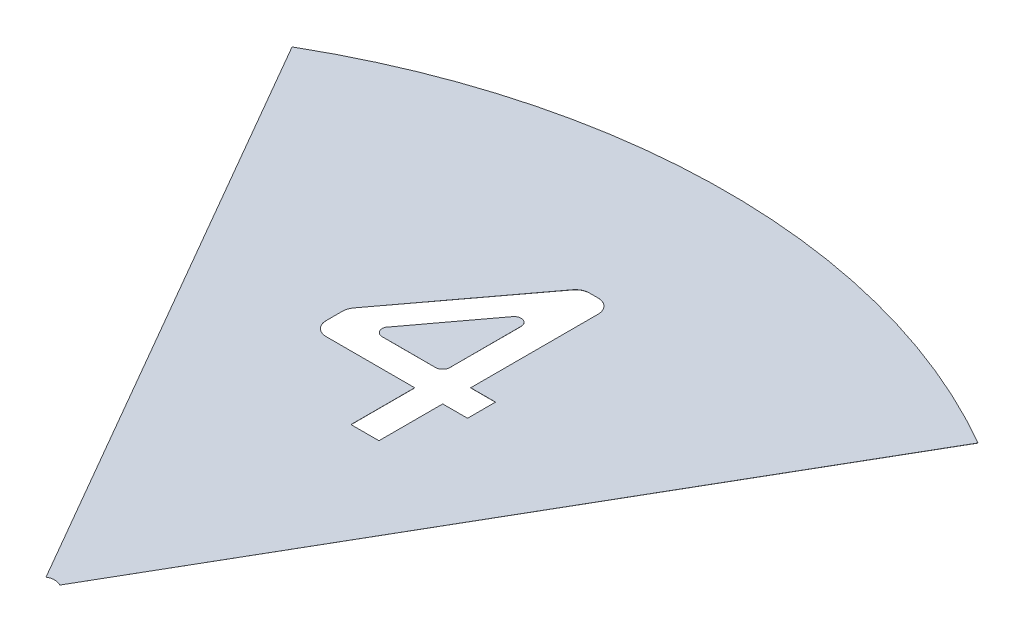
ISO-10303-21;
HEADER;
FILE_DESCRIPTION(('STEP AP214'),'2;1');
FILE_NAME('part.step','',(''),(''),'','','');
FILE_SCHEMA(('AUTOMOTIVE_DESIGN { 1 0 10303 214 1 1 1 1 }'));
ENDSEC;
DATA;
#1=APPLICATION_CONTEXT('core data for automotive mechanical design processes');
#2=APPLICATION_PROTOCOL_DEFINITION('international standard','automotive_design',2000,#1);
#3=PRODUCT_CONTEXT('',#1,'mechanical');
#4=PRODUCT('Part','Part','',(#3));
#5=PRODUCT_RELATED_PRODUCT_CATEGORY('part','',(#4));
#6=PRODUCT_DEFINITION_FORMATION('','',#4);
#7=PRODUCT_DEFINITION_CONTEXT('part definition',#1,'design');
#8=PRODUCT_DEFINITION('design','',#6,#7);
#9=PRODUCT_DEFINITION_SHAPE('','',#8);
#10=(LENGTH_UNIT() NAMED_UNIT(*) SI_UNIT(.MILLI.,.METRE.));
#11=(NAMED_UNIT(*) PLANE_ANGLE_UNIT() SI_UNIT($,.RADIAN.));
#12=(NAMED_UNIT(*) SI_UNIT($,.STERADIAN.) SOLID_ANGLE_UNIT());
#13=UNCERTAINTY_MEASURE_WITH_UNIT(LENGTH_MEASURE(1.E-05),#10,'distance_accuracy_value','');
#14=(GEOMETRIC_REPRESENTATION_CONTEXT(3) GLOBAL_UNCERTAINTY_ASSIGNED_CONTEXT((#13)) GLOBAL_UNIT_ASSIGNED_CONTEXT((#10,
#11,#12)) REPRESENTATION_CONTEXT('',''));
#15=CARTESIAN_POINT('',(0.,0.,0.));
#16=DIRECTION('',(0.,0.,1.));
#17=DIRECTION('',(1.,0.,0.));
#18=AXIS2_PLACEMENT_3D('',#15,#16,#17);
#19=CARTESIAN_POINT('',(-7.76761262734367,-18.3543188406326,-23.9802611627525));
#20=DIRECTION('',(0.,1.,0.));
#21=DIRECTION('',(0.,0.,1.));
#22=AXIS2_PLACEMENT_3D('',#19,#20,#21);
#23=CYLINDRICAL_SURFACE('',#22,0.510000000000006);
#24=CARTESIAN_POINT('',(-7.76761262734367,-8.36431884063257,-23.9802611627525));
#25=DIRECTION('',(0.,1.,0.));
#26=DIRECTION('',(0.,0.,1.));
#27=AXIS2_PLACEMENT_3D('',#24,#25,#26);
#28=CIRCLE('',#27,0.510000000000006);
#29=CARTESIAN_POINT('',(-7.25761262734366,-8.36431884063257,-23.9802611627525));
#30=VERTEX_POINT('',#29);
#31=CARTESIAN_POINT('',(-8.17575951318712,-8.36431884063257,-24.2860652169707));
#32=VERTEX_POINT('',#31);
#33=EDGE_CURVE('P0_E55',#30,#32,#28,.T.);
#34=ORIENTED_EDGE('',*,*,#33,.T.);
#35=DIRECTION('',(0.,1.,0.));
#36=VECTOR('',#35,1.);
#37=CARTESIAN_POINT('',(-8.17575951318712,-18.3543188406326,-24.2860652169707));
#38=LINE('',#37,#36);
#39=CARTESIAN_POINT('',(-8.17575951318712,-8.35431884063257,-24.2860652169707));
#40=VERTEX_POINT('',#39);
#41=EDGE_CURVE('P0_E56',#32,#40,#38,.T.);
#42=ORIENTED_EDGE('',*,*,#41,.T.);
#43=CARTESIAN_POINT('',(-7.76761262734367,-8.35431884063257,-23.9802611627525));
#44=DIRECTION('',(0.,1.,0.));
#45=DIRECTION('',(0.,0.,1.));
#46=AXIS2_PLACEMENT_3D('',#43,#44,#45);
#47=CIRCLE('',#46,0.510000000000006);
#48=CARTESIAN_POINT('',(-7.25761262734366,-8.35431884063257,-23.9802611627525));
#49=VERTEX_POINT('',#48);
#50=EDGE_CURVE('P0_E20',#49,#40,#47,.T.);
#51=ORIENTED_EDGE('',*,*,#50,.F.);
#52=DIRECTION('',(0.,1.,0.));
#53=VECTOR('',#52,1.);
#54=CARTESIAN_POINT('',(-7.25761262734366,-18.3543188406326,-23.9802611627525));
#55=LINE('',#54,#53);
#56=EDGE_CURVE('P0_E57',#30,#49,#55,.T.);
#57=ORIENTED_EDGE('',*,*,#56,.F.);
#58=EDGE_LOOP('',(#34,#42,#51,#57));
#59=FACE_BOUND('',#58,.T.);
#60=ADVANCED_FACE('P0_F15',(#59),#23,.T.);
#61=CARTESIAN_POINT('',(-12.0778714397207,-18.3543188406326,-19.078041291));
#62=DIRECTION('',(-0.80028801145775,0.,-0.599615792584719));
#63=DIRECTION('',(-0.599615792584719,0.,0.80028801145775));
#64=AXIS2_PLACEMENT_3D('',#61,#62,#63);
#65=PLANE('',#64);
#66=DIRECTION('',(-0.599615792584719,0.,0.80028801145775));
#67=VECTOR('',#66,1.);
#68=CARTESIAN_POINT('',(-24.6691185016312,-8.36431884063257,-2.27290674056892));
#69=LINE('',#68,#67);
#70=CARTESIAN_POINT('',(-12.0778714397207,-8.35931884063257,-19.078041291));
#71=VERTEX_POINT('',#70);
#72=EDGE_CURVE('P0_E64',#32,#71,#69,.T.);
#73=ORIENTED_EDGE('',*,*,#72,.T.);
#74=CARTESIAN_POINT('',(-8.17575951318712,-8.35431884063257,-24.2860652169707));
#75=CARTESIAN_POINT('',(-12.0778714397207,-8.35431884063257,-19.078041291));
#76=B_SPLINE_CURVE_WITH_KNOTS('',1,(#74,#75),.UNSPECIFIED.,.F.,.F.,(2,2),(0.,1.),.UNSPECIFIED.);
#77=EDGE_CURVE('P0_E10',#40,#71,#76,.T.);
#78=ORIENTED_EDGE('',*,*,#77,.F.);
#79=ORIENTED_EDGE('',*,*,#41,.F.);
#80=EDGE_LOOP('',(#73,#78,#79));
#81=FACE_BOUND('',#80,.T.);
#82=ADVANCED_FACE('P0_F63',(#81),#65,.T.);
#83=CARTESIAN_POINT('',(-7.25761262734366,-18.3543188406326,-23.9802611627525));
#84=DIRECTION('',(1.,0.,0.));
#85=DIRECTION('',(0.,0.,-1.));
#86=AXIS2_PLACEMENT_3D('',#83,#84,#85);
#87=PLANE('',#86);
#88=DIRECTION('',(0.,0.,-1.));
#89=VECTOR('',#88,1.);
#90=CARTESIAN_POINT('',(-7.25761262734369,-8.36431884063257,10.0331602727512));
#91=LINE('',#90,#89);
#92=CARTESIAN_POINT('',(-7.25761262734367,-8.35931884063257,-18.7722372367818));
#93=VERTEX_POINT('',#92);
#94=EDGE_CURVE('P0_E70',#93,#30,#91,.T.);
#95=ORIENTED_EDGE('',*,*,#94,.T.);
#96=ORIENTED_EDGE('',*,*,#56,.T.);
#97=CARTESIAN_POINT('',(-7.25761262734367,-8.35431884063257,-18.7722372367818));
#98=CARTESIAN_POINT('',(-7.25761262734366,-8.35431884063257,-23.9802611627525));
#99=B_SPLINE_CURVE_WITH_KNOTS('',1,(#97,#98),.UNSPECIFIED.,.F.,.F.,(2,2),(0.,1.),.UNSPECIFIED.);
#100=EDGE_CURVE('P0_E133',#93,#49,#99,.T.);
#101=ORIENTED_EDGE('',*,*,#100,.F.);
#102=EDGE_LOOP('',(#95,#96,#101));
#103=FACE_BOUND('',#102,.T.);
#104=ADVANCED_FACE('P0_F105',(#103),#87,.T.);
#105=CARTESIAN_POINT('',(-8.24460463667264,-8.36431884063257,10.0331602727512));
#106=DIRECTION('',(0.,1.,0.));
#107=DIRECTION('',(0.,0.,1.));
#108=AXIS2_PLACEMENT_3D('',#105,#106,#107);
#109=PLANE('',#108);
#110=CARTESIAN_POINT('',(-12.0778714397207,-8.35431884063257,-19.078041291));
#111=CARTESIAN_POINT('',(-12.2645311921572,-8.35431884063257,-18.8262393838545));
#112=CARTESIAN_POINT('',(-12.1258276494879,-8.35431884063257,-18.5440487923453));
#113=CARTESIAN_POINT('',(-12.0578373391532,-8.35431884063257,-18.4057233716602));
#114=CARTESIAN_POINT('',(-11.9176450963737,-8.35431884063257,-18.3265519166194));
#115=CARTESIAN_POINT('',(-11.8049851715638,-8.35431884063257,-18.2629289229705));
#116=CARTESIAN_POINT('',(-11.6697245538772,-8.35431884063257,-18.2622372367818));
#117=B_SPLINE_CURVE_WITH_KNOTS('',2,(#110,#111,#112,#113,#114,#115,#116),.UNSPECIFIED.,.F.,.F.,
(3,2,2,3),(0.,0.5,0.75,1.),.UNSPECIFIED.);
#118=CARTESIAN_POINT('',(-11.6697245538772,-8.35931884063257,-18.2622372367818));
#119=VERTEX_POINT('',#118);
#120=EDGE_CURVE('P0_E68',#71,#119,#117,.T.);
#121=ORIENTED_EDGE('',*,*,#120,.F.);
#122=ORIENTED_EDGE('',*,*,#72,.F.);
#123=ORIENTED_EDGE('',*,*,#33,.F.);
#124=ORIENTED_EDGE('',*,*,#94,.F.);
#125=CARTESIAN_POINT('',(-7.76761262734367,-8.35431884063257,-18.2622372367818));
#126=CARTESIAN_POINT('',(-7.55692243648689,-8.35431884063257,-18.2630878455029));
#127=CARTESIAN_POINT('',(-7.40698816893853,-8.35431884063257,-18.4116127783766));
#128=CARTESIAN_POINT('',(-7.25847460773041,-8.35431884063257,-18.5587303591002));
#129=CARTESIAN_POINT('',(-7.25761262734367,-8.35431884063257,-18.7722372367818));
#130=B_SPLINE_CURVE_WITH_KNOTS('',2,(#125,#126,#127,#128,#129),.UNSPECIFIED.,.F.,.F.,(3,2,3),
(0.,0.5,1.),.UNSPECIFIED.);
#131=CARTESIAN_POINT('',(-7.76761262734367,-8.35931884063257,-18.2622372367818));
#132=VERTEX_POINT('',#131);
#133=EDGE_CURVE('P0_E124',#132,#93,#130,.T.);
#134=ORIENTED_EDGE('',*,*,#133,.F.);
#135=DIRECTION('',(1.,0.,0.));
#136=VECTOR('',#135,1.);
#137=CARTESIAN_POINT('',(-8.24460463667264,-8.36431884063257,-18.2622372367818));
#138=LINE('',#137,#136);
#139=EDGE_CURVE('P0_E72',#119,#132,#138,.T.);
#140=ORIENTED_EDGE('',*,*,#139,.F.);
#141=EDGE_LOOP('',(#121,#122,#123,#124,#134,#140));
#142=FACE_BOUND('',#141,.T.);
#143=ADVANCED_FACE('P0_F66',(#142),#109,.F.);
#144=CARTESIAN_POINT('',(-7.76761262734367,-18.3543188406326,-18.2622372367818));
#145=DIRECTION('',(0.,0.,1.));
#146=DIRECTION('',(1.,0.,0.));
#147=AXIS2_PLACEMENT_3D('',#144,#145,#146);
#148=PLANE('',#147);
#149=ORIENTED_EDGE('',*,*,#139,.T.);
#150=CARTESIAN_POINT('',(-11.6697245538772,-8.35431884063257,-18.2622372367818));
#151=CARTESIAN_POINT('',(-7.76761262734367,-8.35431884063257,-18.2622372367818));
#152=B_SPLINE_CURVE_WITH_KNOTS('',1,(#150,#151),.UNSPECIFIED.,.F.,.F.,(2,2),(0.,1.),.UNSPECIFIED.);
#153=EDGE_CURVE('P0_E115',#119,#132,#152,.T.);
#154=ORIENTED_EDGE('',*,*,#153,.F.);
#155=EDGE_LOOP('',(#149,#154));
#156=FACE_BOUND('',#155,.T.);
#157=ADVANCED_FACE('P0_F104',(#156),#148,.T.);
#158=CARTESIAN_POINT('',(-8.24460463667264,-8.35431884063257,10.0331602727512));
#159=DIRECTION('',(0.,1.,0.));
#160=DIRECTION('',(0.,0.,1.));
#161=AXIS2_PLACEMENT_3D('',#158,#159,#160);
#162=PLANE('',#161);
#163=ORIENTED_EDGE('',*,*,#120,.T.);
#164=ORIENTED_EDGE('',*,*,#153,.T.);
#165=ORIENTED_EDGE('',*,*,#133,.T.);
#166=ORIENTED_EDGE('',*,*,#100,.T.);
#167=ORIENTED_EDGE('',*,*,#50,.T.);
#168=ORIENTED_EDGE('',*,*,#77,.T.);
#169=EDGE_LOOP('',(#163,#164,#165,#166,#167,#168));
#170=FACE_BOUND('',#169,.T.);
#171=ADVANCED_FACE('P0_F17',(#170),#162,.T.);
#172=CLOSED_SHELL('',(#60,#82,#104,#143,#157,#171));
#173=MANIFOLD_SOLID_BREP('P0_B1',#172);
#174=CARTESIAN_POINT('',(-7.25761262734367,-18.3543188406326,-16.2222372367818));
#175=DIRECTION('',(0.,0.,1.));
#176=DIRECTION('',(1.,0.,0.));
#177=AXIS2_PLACEMENT_3D('',#174,#175,#176);
#178=PLANE('',#177);
#179=DIRECTION('',(0.,1.,0.));
#180=VECTOR('',#179,1.);
#181=CARTESIAN_POINT('',(-13.7091126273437,-18.3543188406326,-16.2222372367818));
#182=LINE('',#181,#180);
#183=CARTESIAN_POINT('',(-13.7091126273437,-8.36431884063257,-16.2222372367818));
#184=VERTEX_POINT('',#183);
#185=CARTESIAN_POINT('',(-13.7091126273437,-8.35431884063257,-16.2222372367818));
#186=VERTEX_POINT('',#185);
#187=EDGE_CURVE('P1_E281',#184,#186,#182,.T.);
#188=ORIENTED_EDGE('',*,*,#187,.T.);
#189=DIRECTION('',(1.,0.,0.));
#190=VECTOR('',#189,1.);
#191=CARTESIAN_POINT('',(-7.25761262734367,-8.35431884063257,-16.2222372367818));
#192=LINE('',#191,#190);
#193=CARTESIAN_POINT('',(-7.25761262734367,-8.35431884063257,-16.2222372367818));
#194=VERTEX_POINT('',#193);
#195=EDGE_CURVE('P1_E289',#186,#194,#192,.T.);
#196=ORIENTED_EDGE('',*,*,#195,.T.);
#197=DIRECTION('',(0.,1.,0.));
#198=VECTOR('',#197,1.);
#199=CARTESIAN_POINT('',(-7.25761262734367,-18.3543188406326,-16.2222372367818));
#200=LINE('',#199,#198);
#201=CARTESIAN_POINT('',(-7.25761279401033,-8.36431884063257,-16.2222372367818));
#202=VERTEX_POINT('',#201);
#203=EDGE_CURVE('P1_E295',#202,#194,#200,.T.);
#204=ORIENTED_EDGE('',*,*,#203,.F.);
#205=CARTESIAN_POINT('',(-13.7091126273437,-8.36431884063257,-16.2222372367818));
#206=CARTESIAN_POINT('',(-7.25761262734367,-8.36431884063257,-16.2222372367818));
#207=B_SPLINE_CURVE_WITH_KNOTS('',1,(#205,#206),.UNSPECIFIED.,.F.,.F.,(2,2),(0.,1.),.UNSPECIFIED.);
#208=EDGE_CURVE('P1_E187',#184,#202,#207,.T.);
#209=ORIENTED_EDGE('',*,*,#208,.F.);
#210=EDGE_LOOP('',(#188,#196,#204,#209));
#211=FACE_BOUND('',#210,.T.);
#212=ADVANCED_FACE('P1_F15',(#211),#178,.F.);
#213=CARTESIAN_POINT('',(-7.25761262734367,-18.3543188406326,-11.5755705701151));
#214=DIRECTION('',(-1.,0.,0.));
#215=DIRECTION('',(0.,0.,1.));
#216=AXIS2_PLACEMENT_3D('',#213,#214,#215);
#217=PLANE('',#216);
#218=ORIENTED_EDGE('',*,*,#203,.T.);
#219=DIRECTION('',(0.,0.,1.));
#220=VECTOR('',#219,1.);
#221=CARTESIAN_POINT('',(-7.25761262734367,-8.35431884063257,-11.5755705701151));
#222=LINE('',#221,#220);
#223=CARTESIAN_POINT('',(-7.25761262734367,-8.35431884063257,-11.5755705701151));
#224=VERTEX_POINT('',#223);
#225=EDGE_CURVE('P1_E303',#194,#224,#222,.T.);
#226=ORIENTED_EDGE('',*,*,#225,.T.);
#227=DIRECTION('',(0.,1.,0.));
#228=VECTOR('',#227,1.);
#229=CARTESIAN_POINT('',(-7.25761262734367,-18.3543188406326,-11.5755705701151));
#230=LINE('',#229,#228);
#231=CARTESIAN_POINT('',(-7.25761262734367,-8.36431884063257,-11.5755707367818));
#232=VERTEX_POINT('',#231);
#233=EDGE_CURVE('P1_E306',#232,#224,#230,.T.);
#234=ORIENTED_EDGE('',*,*,#233,.F.);
#235=CARTESIAN_POINT('',(-7.25761262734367,-8.36431884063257,-16.2222372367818));
#236=CARTESIAN_POINT('',(-7.25761262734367,-8.36431884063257,-11.5755705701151));
#237=B_SPLINE_CURVE_WITH_KNOTS('',1,(#235,#236),.UNSPECIFIED.,.F.,.F.,(2,2),(0.,1.),.UNSPECIFIED.);
#238=EDGE_CURVE('P1_E188',#202,#232,#237,.T.);
#239=ORIENTED_EDGE('',*,*,#238,.F.);
#240=EDGE_LOOP('',(#218,#226,#234,#239));
#241=FACE_BOUND('',#240,.T.);
#242=ADVANCED_FACE('P1_F453',(#241),#217,.F.);
#243=CARTESIAN_POINT('',(-5.21761262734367,-18.3543188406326,-11.5755705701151));
#244=DIRECTION('',(0.,0.,1.));
#245=DIRECTION('',(1.,0.,0.));
#246=AXIS2_PLACEMENT_3D('',#243,#244,#245);
#247=PLANE('',#246);
#248=ORIENTED_EDGE('',*,*,#233,.T.);
#249=DIRECTION('',(1.,0.,0.));
#250=VECTOR('',#249,1.);
#251=CARTESIAN_POINT('',(-5.21761262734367,-8.35431884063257,-11.5755705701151));
#252=LINE('',#251,#250);
#253=CARTESIAN_POINT('',(-5.21761262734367,-8.35431884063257,-11.5755705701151));
#254=VERTEX_POINT('',#253);
#255=EDGE_CURVE('P1_E309',#224,#254,#252,.T.);
#256=ORIENTED_EDGE('',*,*,#255,.T.);
#257=DIRECTION('',(0.,1.,0.));
#258=VECTOR('',#257,1.);
#259=CARTESIAN_POINT('',(-5.21761262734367,-18.3543188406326,-11.5755705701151));
#260=LINE('',#259,#258);
#261=CARTESIAN_POINT('',(-5.21761279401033,-8.36431884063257,-11.5755705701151));
#262=VERTEX_POINT('',#261);
#263=EDGE_CURVE('P1_E312',#262,#254,#260,.T.);
#264=ORIENTED_EDGE('',*,*,#263,.F.);
#265=CARTESIAN_POINT('',(-7.25761262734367,-8.36431884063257,-11.5755705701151));
#266=CARTESIAN_POINT('',(-5.21761262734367,-8.36431884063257,-11.5755705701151));
#267=B_SPLINE_CURVE_WITH_KNOTS('',1,(#265,#266),.UNSPECIFIED.,.F.,.F.,(2,2),(0.,1.),.UNSPECIFIED.);
#268=EDGE_CURVE('P1_E192',#232,#262,#267,.T.);
#269=ORIENTED_EDGE('',*,*,#268,.F.);
#270=EDGE_LOOP('',(#248,#256,#264,#269));
#271=FACE_BOUND('',#270,.T.);
#272=ADVANCED_FACE('P1_F418',(#271),#247,.F.);
#273=CARTESIAN_POINT('',(-5.21761262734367,-18.3543188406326,-16.2222372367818));
#274=DIRECTION('',(1.,0.,0.));
#275=DIRECTION('',(0.,0.,-1.));
#276=AXIS2_PLACEMENT_3D('',#273,#274,#275);
#277=PLANE('',#276);
#278=ORIENTED_EDGE('',*,*,#263,.T.);
#279=DIRECTION('',(0.,0.,-1.));
#280=VECTOR('',#279,1.);
#281=CARTESIAN_POINT('',(-5.21761262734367,-8.35431884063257,-16.2222372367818));
#282=LINE('',#281,#280);
#283=CARTESIAN_POINT('',(-5.21761262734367,-8.35431884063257,-16.2222372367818));
#284=VERTEX_POINT('',#283);
#285=EDGE_CURVE('P1_E315',#254,#284,#282,.T.);
#286=ORIENTED_EDGE('',*,*,#285,.T.);
#287=DIRECTION('',(0.,1.,0.));
#288=VECTOR('',#287,1.);
#289=CARTESIAN_POINT('',(-5.21761262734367,-18.3543188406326,-16.2222372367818));
#290=LINE('',#289,#288);
#291=CARTESIAN_POINT('',(-5.21761262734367,-8.36431884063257,-16.2222370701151));
#292=VERTEX_POINT('',#291);
#293=EDGE_CURVE('P1_E318',#292,#284,#290,.T.);
#294=ORIENTED_EDGE('',*,*,#293,.F.);
#295=CARTESIAN_POINT('',(-5.21761262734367,-8.36431884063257,-11.5755705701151));
#296=CARTESIAN_POINT('',(-5.21761262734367,-8.36431884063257,-16.2222372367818));
#297=B_SPLINE_CURVE_WITH_KNOTS('',1,(#295,#296),.UNSPECIFIED.,.F.,.F.,(2,2),(0.,1.),.UNSPECIFIED.);
#298=EDGE_CURVE('P1_E389',#262,#292,#297,.T.);
#299=ORIENTED_EDGE('',*,*,#298,.F.);
#300=EDGE_LOOP('',(#278,#286,#294,#299));
#301=FACE_BOUND('',#300,.T.);
#302=ADVANCED_FACE('P1_F427',(#301),#277,.F.);
#303=CARTESIAN_POINT('',(-3.40711262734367,-18.3543188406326,-16.2222372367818));
#304=DIRECTION('',(0.,0.,1.));
#305=DIRECTION('',(1.,0.,0.));
#306=AXIS2_PLACEMENT_3D('',#303,#304,#305);
#307=PLANE('',#306);
#308=ORIENTED_EDGE('',*,*,#293,.T.);
#309=DIRECTION('',(1.,0.,0.));
#310=VECTOR('',#309,1.);
#311=CARTESIAN_POINT('',(-3.40711262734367,-8.35431884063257,-16.2222372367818));
#312=LINE('',#311,#310);
#313=CARTESIAN_POINT('',(-3.40711262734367,-8.35431884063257,-16.2222372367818));
#314=VERTEX_POINT('',#313);
#315=EDGE_CURVE('P1_E321',#284,#314,#312,.T.);
#316=ORIENTED_EDGE('',*,*,#315,.T.);
#317=DIRECTION('',(0.,1.,0.));
#318=VECTOR('',#317,1.);
#319=CARTESIAN_POINT('',(-3.40711262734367,-18.3543188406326,-16.2222372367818));
#320=LINE('',#319,#318);
#321=CARTESIAN_POINT('',(-3.40711279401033,-8.36431884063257,-16.2222372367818));
#322=VERTEX_POINT('',#321);
#323=EDGE_CURVE('P1_E324',#322,#314,#320,.T.);
#324=ORIENTED_EDGE('',*,*,#323,.F.);
#325=CARTESIAN_POINT('',(-5.21761262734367,-8.36431884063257,-16.2222372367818));
#326=CARTESIAN_POINT('',(-3.40711262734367,-8.36431884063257,-16.2222372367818));
#327=B_SPLINE_CURVE_WITH_KNOTS('',1,(#325,#326),.UNSPECIFIED.,.F.,.F.,(2,2),(0.,1.),.UNSPECIFIED.);
#328=EDGE_CURVE('P1_E379',#292,#322,#327,.T.);
#329=ORIENTED_EDGE('',*,*,#328,.F.);
#330=EDGE_LOOP('',(#308,#316,#324,#329));
#331=FACE_BOUND('',#330,.T.);
#332=ADVANCED_FACE('P1_F433',(#331),#307,.F.);
#333=CARTESIAN_POINT('',(-3.40711262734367,-18.3543188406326,-18.2622372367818));
#334=DIRECTION('',(1.,0.,0.));
#335=DIRECTION('',(0.,0.,-1.));
#336=AXIS2_PLACEMENT_3D('',#333,#334,#335);
#337=PLANE('',#336);
#338=ORIENTED_EDGE('',*,*,#323,.T.);
#339=DIRECTION('',(0.,0.,-1.));
#340=VECTOR('',#339,1.);
#341=CARTESIAN_POINT('',(-3.40711262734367,-8.35431884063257,-18.2622372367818));
#342=LINE('',#341,#340);
#343=CARTESIAN_POINT('',(-3.40711262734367,-8.35431884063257,-18.2622372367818));
#344=VERTEX_POINT('',#343);
#345=EDGE_CURVE('P1_E327',#314,#344,#342,.T.);
#346=ORIENTED_EDGE('',*,*,#345,.T.);
#347=DIRECTION('',(0.,1.,0.));
#348=VECTOR('',#347,1.);
#349=CARTESIAN_POINT('',(-3.40711262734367,-18.3543188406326,-18.2622372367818));
#350=LINE('',#349,#348);
#351=CARTESIAN_POINT('',(-3.40711262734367,-8.36431884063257,-18.2622370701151));
#352=VERTEX_POINT('',#351);
#353=EDGE_CURVE('P1_E330',#352,#344,#350,.T.);
#354=ORIENTED_EDGE('',*,*,#353,.F.);
#355=CARTESIAN_POINT('',(-3.40711262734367,-8.36431884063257,-16.2222372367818));
#356=CARTESIAN_POINT('',(-3.40711262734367,-8.36431884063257,-18.2622372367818));
#357=B_SPLINE_CURVE_WITH_KNOTS('',1,(#355,#356),.UNSPECIFIED.,.F.,.F.,(2,2),(0.,1.),.UNSPECIFIED.);
#358=EDGE_CURVE('P1_E369',#322,#352,#357,.T.);
#359=ORIENTED_EDGE('',*,*,#358,.F.);
#360=EDGE_LOOP('',(#338,#346,#354,#359));
#361=FACE_BOUND('',#360,.T.);
#362=ADVANCED_FACE('P1_F437',(#361),#337,.F.);
#363=CARTESIAN_POINT('',(-5.21761262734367,-18.3543188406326,-18.2622372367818));
#364=DIRECTION('',(0.,0.,-1.));
#365=DIRECTION('',(-1.,0.,0.));
#366=AXIS2_PLACEMENT_3D('',#363,#364,#365);
#367=PLANE('',#366);
#368=ORIENTED_EDGE('',*,*,#353,.T.);
#369=DIRECTION('',(-1.,0.,0.));
#370=VECTOR('',#369,1.);
#371=CARTESIAN_POINT('',(-5.21761262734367,-8.35431884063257,-18.2622372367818));
#372=LINE('',#371,#370);
#373=CARTESIAN_POINT('',(-5.21761262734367,-8.35431884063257,-18.2622372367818));
#374=VERTEX_POINT('',#373);
#375=EDGE_CURVE('P1_E333',#344,#374,#372,.T.);
#376=ORIENTED_EDGE('',*,*,#375,.T.);
#377=DIRECTION('',(0.,1.,0.));
#378=VECTOR('',#377,1.);
#379=CARTESIAN_POINT('',(-5.21761262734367,-18.3543188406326,-18.2622372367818));
#380=LINE('',#379,#378);
#381=CARTESIAN_POINT('',(-5.217612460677,-8.36431884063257,-18.2622372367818));
#382=VERTEX_POINT('',#381);
#383=EDGE_CURVE('P1_E336',#382,#374,#380,.T.);
#384=ORIENTED_EDGE('',*,*,#383,.F.);
#385=CARTESIAN_POINT('',(-3.40711262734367,-8.36431884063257,-18.2622372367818));
#386=CARTESIAN_POINT('',(-5.21761262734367,-8.36431884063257,-18.2622372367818));
#387=B_SPLINE_CURVE_WITH_KNOTS('',1,(#385,#386),.UNSPECIFIED.,.F.,.F.,(2,2),(0.,1.),.UNSPECIFIED.);
#388=EDGE_CURVE('P1_E360',#352,#382,#387,.T.);
#389=ORIENTED_EDGE('',*,*,#388,.F.);
#390=EDGE_LOOP('',(#368,#376,#384,#389));
#391=FACE_BOUND('',#390,.T.);
#392=ADVANCED_FACE('P1_F445',(#391),#367,.F.);
#393=CARTESIAN_POINT('',(-5.21761262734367,-18.3543188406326,-27.5555705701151));
#394=DIRECTION('',(1.,0.,0.));
#395=DIRECTION('',(0.,0.,-1.));
#396=AXIS2_PLACEMENT_3D('',#393,#394,#395);
#397=PLANE('',#396);
#398=ORIENTED_EDGE('',*,*,#383,.T.);
#399=DIRECTION('',(0.,0.,-1.));
#400=VECTOR('',#399,1.);
#401=CARTESIAN_POINT('',(-5.21761262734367,-8.35431884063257,-27.5555705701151));
#402=LINE('',#401,#400);
#403=CARTESIAN_POINT('',(-5.21761262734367,-8.35431884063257,-27.5555705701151));
#404=VERTEX_POINT('',#403);
#405=EDGE_CURVE('P1_E339',#374,#404,#402,.T.);
#406=ORIENTED_EDGE('',*,*,#405,.T.);
#407=DIRECTION('',(0.,1.,0.));
#408=VECTOR('',#407,1.);
#409=CARTESIAN_POINT('',(-5.21761262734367,-18.3543188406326,-27.5555705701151));
#410=LINE('',#409,#408);
#411=CARTESIAN_POINT('',(-5.21761262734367,-8.36431884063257,-27.5555705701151));
#412=VERTEX_POINT('',#411);
#413=EDGE_CURVE('P1_E107',#412,#404,#410,.T.);
#414=ORIENTED_EDGE('',*,*,#413,.F.);
#415=CARTESIAN_POINT('',(-5.21761262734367,-8.36431884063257,-18.2622372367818));
#416=CARTESIAN_POINT('',(-5.21761262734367,-8.36431884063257,-27.5555705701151));
#417=B_SPLINE_CURVE_WITH_KNOTS('',1,(#415,#416),.UNSPECIFIED.,.F.,.F.,(2,2),(0.,1.),.UNSPECIFIED.);
#418=EDGE_CURVE('P1_E118',#382,#412,#417,.T.);
#419=ORIENTED_EDGE('',*,*,#418,.F.);
#420=EDGE_LOOP('',(#398,#406,#414,#419));
#421=FACE_BOUND('',#420,.T.);
#422=ADVANCED_FACE('P1_F261',(#421),#397,.F.);
#423=CARTESIAN_POINT('',(-8.24460463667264,-8.35431884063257,10.0331602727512));
#424=DIRECTION('',(0.,-1.,0.));
#425=DIRECTION('',(0.,0.,-1.));
#426=AXIS2_PLACEMENT_3D('',#423,#424,#425);
#427=CYLINDRICAL_SURFACE('',#426,50.);
#428=CARTESIAN_POINT('',(-8.24460463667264,-8.36431884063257,10.0331602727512));
#429=DIRECTION('',(0.,1.,0.));
#430=DIRECTION('',(0.499999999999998,0.,-0.86602540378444));
#431=AXIS2_PLACEMENT_3D('',#428,#429,#430);
#432=CIRCLE('',#431,50.);
#433=CARTESIAN_POINT('',(16.7553953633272,-8.36431884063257,-33.2681099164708));
#434=VERTEX_POINT('',#433);
#435=CARTESIAN_POINT('',(-33.2446046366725,-8.36431884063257,-33.2681099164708));
#436=VERTEX_POINT('',#435);
#437=EDGE_CURVE('P1_E218',#434,#436,#432,.T.);
#438=ORIENTED_EDGE('',*,*,#437,.T.);
#439=DIRECTION('',(0.,-1.,0.));
#440=VECTOR('',#439,1.);
#441=CARTESIAN_POINT('',(-33.2446046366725,-8.35431884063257,-33.2681099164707));
#442=LINE('',#441,#440);
#443=CARTESIAN_POINT('',(-33.2446046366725,-8.35431884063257,-33.2681099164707));
#444=VERTEX_POINT('',#443);
#445=EDGE_CURVE('P1_E238',#444,#436,#442,.T.);
#446=ORIENTED_EDGE('',*,*,#445,.F.);
#447=CARTESIAN_POINT('',(-8.24460463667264,-8.35431884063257,10.0331602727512));
#448=DIRECTION('',(0.,1.,0.));
#449=DIRECTION('',(0.,0.,1.));
#450=AXIS2_PLACEMENT_3D('',#447,#448,#449);
#451=CIRCLE('',#450,50.);
#452=CARTESIAN_POINT('',(16.7553953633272,-8.35431884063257,-33.2681099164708));
#453=VERTEX_POINT('',#452);
#454=EDGE_CURVE('P1_E235',#453,#444,#451,.T.);
#455=ORIENTED_EDGE('',*,*,#454,.F.);
#456=DIRECTION('',(0.,-1.,0.));
#457=VECTOR('',#456,1.);
#458=CARTESIAN_POINT('',(16.7553953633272,-8.35431884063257,-33.2681099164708));
#459=LINE('',#458,#457);
#460=EDGE_CURVE('P1_E36',#453,#434,#459,.T.);
#461=ORIENTED_EDGE('',*,*,#460,.T.);
#462=EDGE_LOOP('',(#438,#446,#455,#461));
#463=FACE_BOUND('',#462,.T.);
#464=ADVANCED_FACE('P1_F250',(#463),#427,.T.);
#465=CARTESIAN_POINT('',(-8.74460463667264,-8.35431884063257,9.16713486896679));
#466=DIRECTION('',(0.86602540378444,0.,-0.499999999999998));
#467=DIRECTION('',(-0.499999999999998,0.,-0.86602540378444));
#468=AXIS2_PLACEMENT_3D('',#465,#466,#467);
#469=PLANE('',#468);
#470=CARTESIAN_POINT('',(-33.2446046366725,-8.36431884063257,-33.2681099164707));
#471=CARTESIAN_POINT('',(-8.74460463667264,-8.36431884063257,9.16713486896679));
#472=B_SPLINE_CURVE_WITH_KNOTS('',1,(#470,#471),.UNSPECIFIED.,.F.,.F.,(2,2),(0.,1.),.UNSPECIFIED.);
#473=CARTESIAN_POINT('',(-8.74460463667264,-8.35931884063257,9.16713486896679));
#474=VERTEX_POINT('',#473);
#475=EDGE_CURVE('P1_E212',#436,#474,#472,.T.);
#476=ORIENTED_EDGE('',*,*,#475,.T.);
#477=DIRECTION('',(0.499999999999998,0.,0.86602540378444));
#478=VECTOR('',#477,1.);
#479=CARTESIAN_POINT('',(-8.74460463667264,-8.35431884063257,9.16713486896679));
#480=LINE('',#479,#478);
#481=EDGE_CURVE('P1_E234',#444,#474,#480,.T.);
#482=ORIENTED_EDGE('',*,*,#481,.F.);
#483=ORIENTED_EDGE('',*,*,#445,.T.);
#484=EDGE_LOOP('',(#476,#482,#483));
#485=FACE_BOUND('',#484,.T.);
#486=ADVANCED_FACE('P1_F260',(#485),#469,.F.);
#487=CARTESIAN_POINT('',(-7.74460463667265,-8.35431884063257,9.16713486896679));
#488=DIRECTION('',(-0.86602540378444,0.,-0.499999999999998));
#489=DIRECTION('',(-0.499999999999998,0.,0.86602540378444));
#490=AXIS2_PLACEMENT_3D('',#487,#488,#489);
#491=PLANE('',#490);
#492=CARTESIAN_POINT('',(-7.74460463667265,-8.36431884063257,9.16713486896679));
#493=CARTESIAN_POINT('',(16.7553953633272,-8.36431884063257,-33.2681099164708));
#494=B_SPLINE_CURVE_WITH_KNOTS('',1,(#492,#493),.UNSPECIFIED.,.F.,.F.,(2,2),(0.,1.),.UNSPECIFIED.);
#495=CARTESIAN_POINT('',(-7.74460463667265,-8.35931884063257,9.16713486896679));
#496=VERTEX_POINT('',#495);
#497=EDGE_CURVE('P1_E10',#496,#434,#494,.T.);
#498=ORIENTED_EDGE('',*,*,#497,.T.);
#499=ORIENTED_EDGE('',*,*,#460,.F.);
#500=DIRECTION('',(0.499999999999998,0.,-0.86602540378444));
#501=VECTOR('',#500,1.);
#502=CARTESIAN_POINT('',(-7.74460463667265,-8.35431884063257,9.16713486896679));
#503=LINE('',#502,#501);
#504=EDGE_CURVE('P1_E173',#496,#453,#503,.T.);
#505=ORIENTED_EDGE('',*,*,#504,.F.);
#506=EDGE_LOOP('',(#498,#499,#505));
#507=FACE_BOUND('',#506,.T.);
#508=ADVANCED_FACE('P1_F265',(#507),#491,.F.);
#509=CARTESIAN_POINT('',(-13.7091126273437,-18.3543188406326,-17.2422372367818));
#510=DIRECTION('',(0.,1.,0.));
#511=DIRECTION('',(0.,0.,1.));
#512=AXIS2_PLACEMENT_3D('',#509,#510,#511);
#513=CYLINDRICAL_SURFACE('',#512,1.02);
#514=CARTESIAN_POINT('',(-13.7091126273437,-8.35431884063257,-17.2422372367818));
#515=DIRECTION('',(0.,1.,0.));
#516=DIRECTION('',(0.,0.,1.));
#517=AXIS2_PLACEMENT_3D('',#514,#515,#516);
#518=CIRCLE('',#517,1.02);
#519=CARTESIAN_POINT('',(-14.7291126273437,-8.35931884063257,-17.2422372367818));
#520=VERTEX_POINT('',#519);
#521=EDGE_CURVE('P1_E164',#520,#186,#518,.T.);
#522=ORIENTED_EDGE('',*,*,#521,.T.);
#523=ORIENTED_EDGE('',*,*,#187,.F.);
#524=CARTESIAN_POINT('',(-14.7291126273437,-8.36431884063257,-17.2422372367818));
#525=CARTESIAN_POINT('',(-14.7290643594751,-8.36431884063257,-17.1481353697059));
#526=CARTESIAN_POINT('',(-14.7120841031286,-8.36431884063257,-17.0566349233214));
#527=CARTESIAN_POINT('',(-14.6938802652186,-8.36431884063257,-16.9585410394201));
#528=CARTESIAN_POINT('',(-14.6574966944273,-8.36431884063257,-16.8667806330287));
#529=CARTESIAN_POINT('',(-14.6191875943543,-8.36431884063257,-16.7701639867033));
#530=CARTESIAN_POINT('',(-14.5628480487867,-8.36431884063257,-16.6840832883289));
#531=CARTESIAN_POINT('',(-14.5047223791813,-8.36431884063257,-16.5952735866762));
#532=CARTESIAN_POINT('',(-14.4303615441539,-8.36431884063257,-16.5209883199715));
#533=CARTESIAN_POINT('',(-14.3552709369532,-8.36431884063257,-16.4459740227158));
#534=CARTESIAN_POINT('',(-14.2672665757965,-8.36431884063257,-16.3885018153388));
#535=CARTESIAN_POINT('',(-14.1802452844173,-8.36431884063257,-16.3316716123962));
#536=CARTESIAN_POINT('',(-14.0845692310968,-8.36431884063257,-16.2938531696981));
#537=CARTESIAN_POINT('',(-13.9917861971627,-8.36431884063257,-16.2571782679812));
#538=CARTESIAN_POINT('',(-13.8947149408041,-8.36431884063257,-16.2392657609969));
#539=CARTESIAN_POINT('',(-13.8026942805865,-8.36431884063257,-16.2222852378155));
#540=CARTESIAN_POINT('',(-13.7091126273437,-8.36431884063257,-16.2222372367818));
#541=B_SPLINE_CURVE_WITH_KNOTS('',2,(#524,#525,#526,#527,#528,#529,#530,#531,#532,#533,#534,
#535,#536,#537,#538,#539,#540),.UNSPECIFIED.,.F.,.F.,(3,2,2,2,2,2,2,2,3),(0.,0.125,0.25,0.375,
0.5,0.625,0.75,0.875,1.),.UNSPECIFIED.);
#542=EDGE_CURVE('P1_E181',#520,#184,#541,.T.);
#543=ORIENTED_EDGE('',*,*,#542,.F.);
#544=EDGE_LOOP('',(#522,#523,#543));
#545=FACE_BOUND('',#544,.T.);
#546=ADVANCED_FACE('P1_F269',(#545),#513,.F.);
#547=CARTESIAN_POINT('',(-7.68880639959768,-18.3543188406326,-28.1671786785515));
#548=DIRECTION('',(-0.800288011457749,0.,-0.59961579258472));
#549=DIRECTION('',(-0.59961579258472,0.,0.800288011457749));
#550=AXIS2_PLACEMENT_3D('',#547,#548,#549);
#551=PLANE('',#550);
#552=DIRECTION('',(0.,1.,0.));
#553=VECTOR('',#552,1.);
#554=CARTESIAN_POINT('',(-7.68880639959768,-18.3543188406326,-28.1671786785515));
#555=LINE('',#554,#553);
#556=CARTESIAN_POINT('',(-7.68880639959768,-8.36431884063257,-28.1671786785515));
#557=VERTEX_POINT('',#556);
#558=CARTESIAN_POINT('',(-7.68880639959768,-8.35431884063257,-28.1671786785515));
#559=VERTEX_POINT('',#558);
#560=EDGE_CURVE('P1_E172',#557,#559,#555,.T.);
#561=ORIENTED_EDGE('',*,*,#560,.T.);
#562=DIRECTION('',(-0.59961579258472,0.,0.800288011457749));
#563=VECTOR('',#562,1.);
#564=CARTESIAN_POINT('',(-7.68880639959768,-8.35431884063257,-28.1671786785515));
#565=LINE('',#564,#563);
#566=CARTESIAN_POINT('',(-14.5254063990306,-8.35931884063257,-19.0425874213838));
#567=VERTEX_POINT('',#566);
#568=EDGE_CURVE('P1_E545',#559,#567,#565,.T.);
#569=ORIENTED_EDGE('',*,*,#568,.T.);
#570=CARTESIAN_POINT('',(-7.68880639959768,-8.36431884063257,-28.1671786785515));
#571=CARTESIAN_POINT('',(-14.5254063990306,-8.36431884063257,-19.0425874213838));
#572=B_SPLINE_CURVE_WITH_KNOTS('',1,(#570,#571),.UNSPECIFIED.,.F.,.F.,(2,2),(0.,1.),.UNSPECIFIED.);
#573=EDGE_CURVE('P1_E186',#557,#567,#572,.T.);
#574=ORIENTED_EDGE('',*,*,#573,.F.);
#575=EDGE_LOOP('',(#561,#569,#574));
#576=FACE_BOUND('',#575,.T.);
#577=ADVANCED_FACE('P1_F273',(#576),#551,.F.);
#578=CARTESIAN_POINT('',(-6.87251262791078,-18.3543188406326,-27.5555705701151));
#579=DIRECTION('',(0.,1.,0.));
#580=DIRECTION('',(0.,0.,1.));
#581=AXIS2_PLACEMENT_3D('',#578,#579,#580);
#582=CYLINDRICAL_SURFACE('',#581,1.01999999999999);
#583=CARTESIAN_POINT('',(-6.87251262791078,-8.35431884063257,-27.5555705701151));
#584=DIRECTION('',(0.,1.,0.));
#585=DIRECTION('',(0.,0.,-1.));
#586=AXIS2_PLACEMENT_3D('',#583,#584,#585);
#587=CIRCLE('',#586,1.01999999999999);
#588=CARTESIAN_POINT('',(-6.87251262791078,-8.35931884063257,-28.5755705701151));
#589=VERTEX_POINT('',#588);
#590=EDGE_CURVE('P1_E93',#589,#559,#587,.T.);
#591=ORIENTED_EDGE('',*,*,#590,.T.);
#592=ORIENTED_EDGE('',*,*,#560,.F.);
#593=CARTESIAN_POINT('',(-6.87251262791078,-8.36431884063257,-28.5755705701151));
#594=CARTESIAN_POINT('',(-6.99235795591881,-8.36431884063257,-28.5752647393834));
#595=CARTESIAN_POINT('',(-7.10383983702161,-8.36431884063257,-28.5489927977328));
#596=CARTESIAN_POINT('',(-7.22374207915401,-8.36431884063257,-28.5207365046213));
#597=CARTESIAN_POINT('',(-7.32888951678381,-8.36431884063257,-28.4677767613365));
#598=CARTESIAN_POINT('',(-7.54398914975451,-8.36431884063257,-28.3594372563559));
#599=CARTESIAN_POINT('',(-7.68880639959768,-8.36431884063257,-28.1671786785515));
#600=B_SPLINE_CURVE_WITH_KNOTS('',2,(#593,#594,#595,#596,#597,#598,#599),.UNSPECIFIED.,.F.,.F.,
(3,2,2,3),(0.,0.25,0.5,1.),.UNSPECIFIED.);
#601=EDGE_CURVE('P1_E207',#589,#557,#600,.T.);
#602=ORIENTED_EDGE('',*,*,#601,.F.);
#603=EDGE_LOOP('',(#591,#592,#602));
#604=FACE_BOUND('',#603,.T.);
#605=ADVANCED_FACE('P1_F141',(#604),#582,.F.);
#606=CARTESIAN_POINT('',(-8.24460463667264,-8.35431884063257,10.0331602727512));
#607=DIRECTION('',(0.,1.,0.));
#608=DIRECTION('',(0.,0.,1.));
#609=AXIS2_PLACEMENT_3D('',#606,#607,#608);
#610=PLANE('',#609);
#611=ORIENTED_EDGE('',*,*,#521,.F.);
#612=CARTESIAN_POINT('',(-14.7291126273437,-8.36431884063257,-18.4309793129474));
#613=DIRECTION('',(0.,0.,1.));
#614=VECTOR('',#613,1.);
#615=LINE('',#612,#614);
#616=CARTESIAN_POINT('',(-14.7291126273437,-8.35931884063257,-18.4309793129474));
#617=VERTEX_POINT('',#616);
#618=EDGE_CURVE('P1_E178',#617,#520,#615,.T.);
#619=ORIENTED_EDGE('',*,*,#618,.F.);
#620=CARTESIAN_POINT('',(-14.5254063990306,-8.36431884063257,-19.0425874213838));
#621=CARTESIAN_POINT('',(-14.728500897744,-8.36431884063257,-18.7705034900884));
#622=CARTESIAN_POINT('',(-14.7291126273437,-8.36431884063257,-18.4309793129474));
#623=B_SPLINE_CURVE_WITH_KNOTS('',2,(#620,#621,#622),.UNSPECIFIED.,.F.,.F.,(3,3),(0.,1.),.UNSPECIFIED.);
#624=EDGE_CURVE('P1_E185',#567,#617,#623,.T.);
#625=ORIENTED_EDGE('',*,*,#624,.F.);
#626=ORIENTED_EDGE('',*,*,#568,.F.);
#627=ORIENTED_EDGE('',*,*,#590,.F.);
#628=CARTESIAN_POINT('',(-6.23761262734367,-8.36431884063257,-28.5755705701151));
#629=DIRECTION('',(-1.,0.,0.));
#630=VECTOR('',#629,1.);
#631=LINE('',#628,#630);
#632=CARTESIAN_POINT('',(-6.23761262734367,-8.35931884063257,-28.5755705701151));
#633=VERTEX_POINT('',#632);
#634=EDGE_CURVE('P1_E109',#633,#589,#631,.T.);
#635=ORIENTED_EDGE('',*,*,#634,.F.);
#636=CARTESIAN_POINT('',(-6.23761262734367,-8.35431884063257,-27.5555705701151));
#637=DIRECTION('',(0.,1.,0.));
#638=DIRECTION('',(0.,0.,-1.));
#639=AXIS2_PLACEMENT_3D('',#636,#637,#638);
#640=CIRCLE('',#639,1.02);
#641=EDGE_CURVE('P1_E100',#404,#633,#640,.T.);
#642=ORIENTED_EDGE('',*,*,#641,.F.);
#643=ORIENTED_EDGE('',*,*,#405,.F.);
#644=ORIENTED_EDGE('',*,*,#375,.F.);
#645=ORIENTED_EDGE('',*,*,#345,.F.);
#646=ORIENTED_EDGE('',*,*,#315,.F.);
#647=ORIENTED_EDGE('',*,*,#285,.F.);
#648=ORIENTED_EDGE('',*,*,#255,.F.);
#649=ORIENTED_EDGE('',*,*,#225,.F.);
#650=ORIENTED_EDGE('',*,*,#195,.F.);
#651=EDGE_LOOP('',(#611,#619,#625,#626,#627,#635,#642,#643,#644,#645,#646,#647,#648,#649,#650));
#652=FACE_BOUND('',#651,.T.);
#653=CARTESIAN_POINT('',(-8.74460463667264,-8.35431884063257,9.16713486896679));
#654=CARTESIAN_POINT('',(-8.50960642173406,-8.35431884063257,9.03235079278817));
#655=CARTESIAN_POINT('',(-8.24460463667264,-8.35431884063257,9.03316027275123));
#656=CARTESIAN_POINT('',(-7.97676505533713,-8.35431884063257,9.03397842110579));
#657=CARTESIAN_POINT('',(-7.74460463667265,-8.35431884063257,9.16713486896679));
#658=B_SPLINE_CURVE_WITH_KNOTS('',2,(#653,#654,#655,#656,#657),.UNSPECIFIED.,.F.,.F.,(3,2,3),
(0.,0.5,1.),.UNSPECIFIED.);
#659=EDGE_CURVE('P1_E27',#474,#496,#658,.T.);
#660=ORIENTED_EDGE('',*,*,#659,.T.);
#661=ORIENTED_EDGE('',*,*,#504,.T.);
#662=ORIENTED_EDGE('',*,*,#454,.T.);
#663=ORIENTED_EDGE('',*,*,#481,.T.);
#664=EDGE_LOOP('',(#660,#661,#662,#663));
#665=FACE_BOUND('',#664,.T.);
#666=ADVANCED_FACE('P1_F122',(#652,#665),#610,.T.);
#667=CARTESIAN_POINT('',(-6.23761262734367,-18.3543188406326,-27.5555705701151));
#668=DIRECTION('',(0.,1.,0.));
#669=DIRECTION('',(0.,0.,1.));
#670=AXIS2_PLACEMENT_3D('',#667,#668,#669);
#671=CYLINDRICAL_SURFACE('',#670,1.02);
#672=ORIENTED_EDGE('',*,*,#413,.T.);
#673=ORIENTED_EDGE('',*,*,#641,.T.);
#674=CARTESIAN_POINT('',(-5.21761262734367,-8.36431884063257,-27.5555705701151));
#675=CARTESIAN_POINT('',(-5.21766089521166,-8.36431884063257,-27.649672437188));
#676=CARTESIAN_POINT('',(-5.23464115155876,-8.36431884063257,-27.7411728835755));
#677=CARTESIAN_POINT('',(-5.25284498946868,-8.36431884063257,-27.8392667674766));
#678=CARTESIAN_POINT('',(-5.28922856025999,-8.36431884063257,-27.9310271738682));
#679=CARTESIAN_POINT('',(-5.32753766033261,-8.36431884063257,-28.0276438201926));
#680=CARTESIAN_POINT('',(-5.38387720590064,-8.36431884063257,-28.113724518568));
#681=CARTESIAN_POINT('',(-5.44200287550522,-8.36431884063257,-28.2025342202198));
#682=CARTESIAN_POINT('',(-5.51636371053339,-8.36431884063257,-28.2768194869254));
#683=CARTESIAN_POINT('',(-5.59145431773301,-8.36431884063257,-28.3518337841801));
#684=CARTESIAN_POINT('',(-5.67945867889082,-8.36431884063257,-28.4093059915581));
#685=CARTESIAN_POINT('',(-5.76647997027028,-8.36431884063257,-28.4661361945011));
#686=CARTESIAN_POINT('',(-5.86215602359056,-8.36431884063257,-28.5039546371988));
#687=CARTESIAN_POINT('',(-5.95493905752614,-8.36431884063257,-28.540629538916));
#688=CARTESIAN_POINT('',(-6.05201031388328,-8.36431884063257,-28.5585420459));
#689=CARTESIAN_POINT('',(-6.14403097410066,-8.36431884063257,-28.5755225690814));
#690=CARTESIAN_POINT('',(-6.23761262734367,-8.36431884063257,-28.5755705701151));
#691=B_SPLINE_CURVE_WITH_KNOTS('',2,(#674,#675,#676,#677,#678,#679,#680,#681,#682,#683,#684,
#685,#686,#687,#688,#689,#690),.UNSPECIFIED.,.F.,.F.,(3,2,2,2,2,2,2,2,3),(0.,0.125,0.25,0.375,
0.5,0.625,0.75,0.875,1.),.UNSPECIFIED.);
#692=EDGE_CURVE('P1_E103',#412,#633,#691,.T.);
#693=ORIENTED_EDGE('',*,*,#692,.F.);
#694=EDGE_LOOP('',(#672,#673,#693));
#695=FACE_BOUND('',#694,.T.);
#696=ADVANCED_FACE('P1_F102',(#695),#671,.F.);
#697=CARTESIAN_POINT('',(-8.24460463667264,-8.36431884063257,10.0331602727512));
#698=DIRECTION('',(0.,1.,0.));
#699=DIRECTION('',(0.,0.,1.));
#700=AXIS2_PLACEMENT_3D('',#697,#698,#699);
#701=PLANE('',#700);
#702=ORIENTED_EDGE('',*,*,#634,.T.);
#703=ORIENTED_EDGE('',*,*,#601,.T.);
#704=ORIENTED_EDGE('',*,*,#573,.T.);
#705=ORIENTED_EDGE('',*,*,#624,.T.);
#706=ORIENTED_EDGE('',*,*,#618,.T.);
#707=ORIENTED_EDGE('',*,*,#542,.T.);
#708=ORIENTED_EDGE('',*,*,#208,.T.);
#709=ORIENTED_EDGE('',*,*,#238,.T.);
#710=ORIENTED_EDGE('',*,*,#268,.T.);
#711=ORIENTED_EDGE('',*,*,#298,.T.);
#712=ORIENTED_EDGE('',*,*,#328,.T.);
#713=ORIENTED_EDGE('',*,*,#358,.T.);
#714=ORIENTED_EDGE('',*,*,#388,.T.);
#715=ORIENTED_EDGE('',*,*,#418,.T.);
#716=ORIENTED_EDGE('',*,*,#692,.T.);
#717=EDGE_LOOP('',(#702,#703,#704,#705,#706,#707,#708,#709,#710,#711,#712,#713,#714,#715,#716));
#718=FACE_BOUND('',#717,.T.);
#719=ORIENTED_EDGE('',*,*,#437,.F.);
#720=ORIENTED_EDGE('',*,*,#497,.F.);
#721=ORIENTED_EDGE('',*,*,#659,.F.);
#722=ORIENTED_EDGE('',*,*,#475,.F.);
#723=EDGE_LOOP('',(#719,#720,#721,#722));
#724=FACE_BOUND('',#723,.T.);
#725=ADVANCED_FACE('P1_F17',(#718,#724),#701,.F.);
#726=CLOSED_SHELL('',(#212,#242,#272,#302,#332,#362,#392,#422,#464,#486,#508,#546,#577,#605,
#666,#696,#725));
#727=MANIFOLD_SOLID_BREP('P1_B1',#726);
#728=ADVANCED_BREP_SHAPE_REPRESENTATION('',(#18,#173,#727),#14);
#729=SHAPE_DEFINITION_REPRESENTATION(#9,#728);
ENDSEC;
END-ISO-10303-21;
